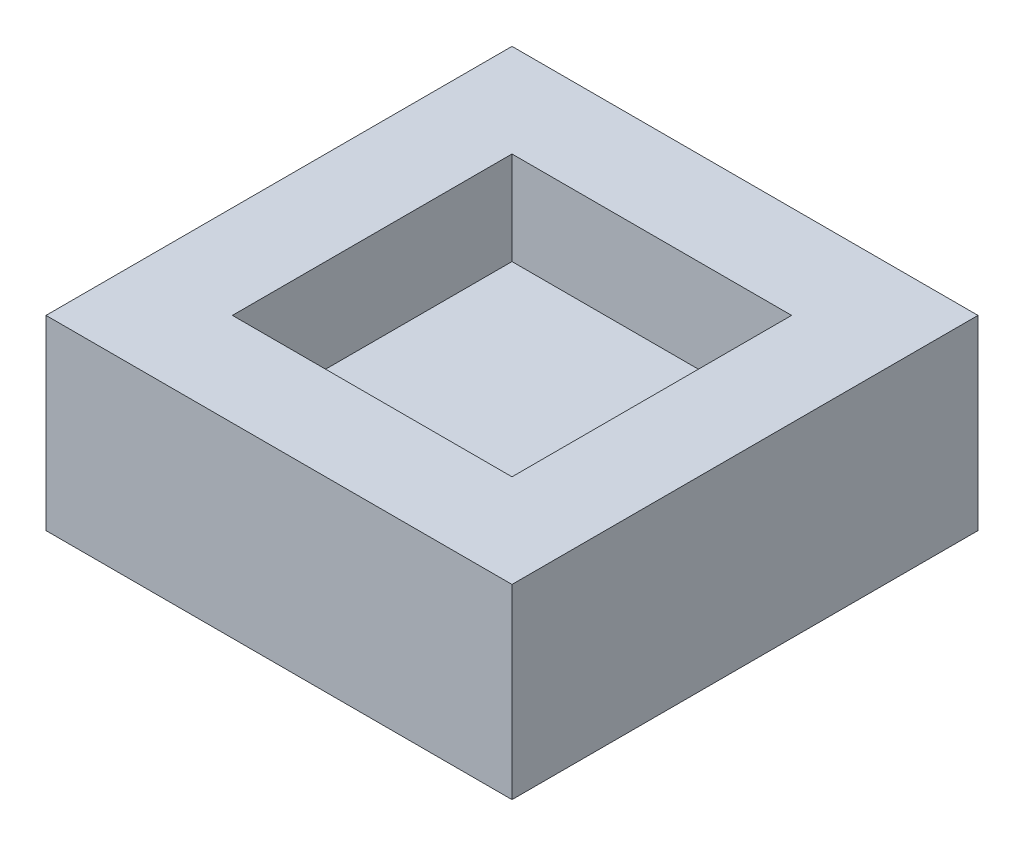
ISO-10303-21;
HEADER;
FILE_DESCRIPTION(('STEP AP214'),'2;1');
FILE_NAME('part.step','',(''),(''),'','','');
FILE_SCHEMA(('AUTOMOTIVE_DESIGN { 1 0 10303 214 1 1 1 1 }'));
ENDSEC;
DATA;
#1=APPLICATION_CONTEXT('core data for automotive mechanical design processes');
#2=APPLICATION_PROTOCOL_DEFINITION('international standard','automotive_design',2000,#1);
#3=PRODUCT_CONTEXT('',#1,'mechanical');
#4=PRODUCT('Part','Part','',(#3));
#5=PRODUCT_RELATED_PRODUCT_CATEGORY('part','',(#4));
#6=PRODUCT_DEFINITION_FORMATION('','',#4);
#7=PRODUCT_DEFINITION_CONTEXT('part definition',#1,'design');
#8=PRODUCT_DEFINITION('design','',#6,#7);
#9=PRODUCT_DEFINITION_SHAPE('','',#8);
#10=(LENGTH_UNIT() NAMED_UNIT(*) SI_UNIT(.MILLI.,.METRE.));
#11=(NAMED_UNIT(*) PLANE_ANGLE_UNIT() SI_UNIT($,.RADIAN.));
#12=(NAMED_UNIT(*) SI_UNIT($,.STERADIAN.) SOLID_ANGLE_UNIT());
#13=UNCERTAINTY_MEASURE_WITH_UNIT(LENGTH_MEASURE(1.E-05),#10,'distance_accuracy_value','');
#14=(GEOMETRIC_REPRESENTATION_CONTEXT(3) GLOBAL_UNCERTAINTY_ASSIGNED_CONTEXT((#13)) GLOBAL_UNIT_ASSIGNED_CONTEXT((#10,
#11,#12)) REPRESENTATION_CONTEXT('',''));
#15=CARTESIAN_POINT('',(0.,0.,0.));
#16=DIRECTION('',(0.,0.,1.));
#17=DIRECTION('',(1.,0.,0.));
#18=AXIS2_PLACEMENT_3D('',#15,#16,#17);
#19=CARTESIAN_POINT('',(0.,20.,0.));
#20=DIRECTION('',(1.,0.,0.));
#21=DIRECTION('',(0.,0.,-1.));
#22=AXIS2_PLACEMENT_3D('',#19,#20,#21);
#23=PLANE('',#22);
#24=DIRECTION('',(0.,0.,1.));
#25=VECTOR('',#24,1.);
#26=CARTESIAN_POINT('',(0.,0.,0.));
#27=LINE('',#26,#25);
#28=CARTESIAN_POINT('',(0.,0.,-50.));
#29=VERTEX_POINT('',#28);
#30=CARTESIAN_POINT('',(0.,0.,0.));
#31=VERTEX_POINT('',#30);
#32=EDGE_CURVE('E135',#29,#31,#27,.T.);
#33=ORIENTED_EDGE('',*,*,#32,.T.);
#34=DIRECTION('',(0.,-1.,0.));
#35=VECTOR('',#34,1.);
#36=CARTESIAN_POINT('',(0.,20.,0.));
#37=LINE('',#36,#35);
#38=CARTESIAN_POINT('',(0.,20.,0.));
#39=VERTEX_POINT('',#38);
#40=EDGE_CURVE('E11',#39,#31,#37,.T.);
#41=ORIENTED_EDGE('',*,*,#40,.F.);
#42=DIRECTION('',(0.,0.,1.));
#43=VECTOR('',#42,1.);
#44=CARTESIAN_POINT('',(0.,20.,0.));
#45=LINE('',#44,#43);
#46=CARTESIAN_POINT('',(0.,20.,-50.));
#47=VERTEX_POINT('',#46);
#48=EDGE_CURVE('E146',#47,#39,#45,.T.);
#49=ORIENTED_EDGE('',*,*,#48,.F.);
#50=DIRECTION('',(0.,-1.,0.));
#51=VECTOR('',#50,1.);
#52=CARTESIAN_POINT('',(0.,20.,-50.));
#53=LINE('',#52,#51);
#54=EDGE_CURVE('E153',#47,#29,#53,.T.);
#55=ORIENTED_EDGE('',*,*,#54,.T.);
#56=EDGE_LOOP('',(#33,#41,#49,#55));
#57=FACE_BOUND('',#56,.T.);
#58=ADVANCED_FACE('F33',(#57),#23,.F.);
#59=CARTESIAN_POINT('',(0.,20.,0.));
#60=DIRECTION('',(0.,0.,-1.));
#61=DIRECTION('',(-1.,0.,0.));
#62=AXIS2_PLACEMENT_3D('',#59,#60,#61);
#63=PLANE('',#62);
#64=DIRECTION('',(1.,0.,0.));
#65=VECTOR('',#64,1.);
#66=CARTESIAN_POINT('',(0.,0.,0.));
#67=LINE('',#66,#65);
#68=CARTESIAN_POINT('',(50.,0.,0.));
#69=VERTEX_POINT('',#68);
#70=EDGE_CURVE('E140',#31,#69,#67,.T.);
#71=ORIENTED_EDGE('',*,*,#70,.T.);
#72=DIRECTION('',(0.,-1.,0.));
#73=VECTOR('',#72,1.);
#74=CARTESIAN_POINT('',(50.,20.,0.));
#75=LINE('',#74,#73);
#76=CARTESIAN_POINT('',(50.,20.,0.));
#77=VERTEX_POINT('',#76);
#78=EDGE_CURVE('E40',#77,#69,#75,.T.);
#79=ORIENTED_EDGE('',*,*,#78,.F.);
#80=DIRECTION('',(1.,0.,0.));
#81=VECTOR('',#80,1.);
#82=CARTESIAN_POINT('',(0.,20.,0.));
#83=LINE('',#82,#81);
#84=EDGE_CURVE('E148',#39,#77,#83,.T.);
#85=ORIENTED_EDGE('',*,*,#84,.F.);
#86=ORIENTED_EDGE('',*,*,#40,.T.);
#87=EDGE_LOOP('',(#71,#79,#85,#86));
#88=FACE_BOUND('',#87,.T.);
#89=ADVANCED_FACE('F175',(#88),#63,.F.);
#90=CARTESIAN_POINT('',(50.,20.,0.));
#91=DIRECTION('',(-1.,0.,0.));
#92=DIRECTION('',(0.,0.,1.));
#93=AXIS2_PLACEMENT_3D('',#90,#91,#92);
#94=PLANE('',#93);
#95=DIRECTION('',(0.,0.,-1.));
#96=VECTOR('',#95,1.);
#97=CARTESIAN_POINT('',(50.,0.,0.));
#98=LINE('',#97,#96);
#99=CARTESIAN_POINT('',(50.,0.,-50.));
#100=VERTEX_POINT('',#99);
#101=EDGE_CURVE('E142',#69,#100,#98,.T.);
#102=ORIENTED_EDGE('',*,*,#101,.T.);
#103=DIRECTION('',(0.,-1.,0.));
#104=VECTOR('',#103,1.);
#105=CARTESIAN_POINT('',(50.,20.,-50.));
#106=LINE('',#105,#104);
#107=CARTESIAN_POINT('',(50.,20.,-50.));
#108=VERTEX_POINT('',#107);
#109=EDGE_CURVE('E156',#108,#100,#106,.T.);
#110=ORIENTED_EDGE('',*,*,#109,.F.);
#111=DIRECTION('',(0.,0.,-1.));
#112=VECTOR('',#111,1.);
#113=CARTESIAN_POINT('',(50.,20.,0.));
#114=LINE('',#113,#112);
#115=EDGE_CURVE('E150',#77,#108,#114,.T.);
#116=ORIENTED_EDGE('',*,*,#115,.F.);
#117=ORIENTED_EDGE('',*,*,#78,.T.);
#118=EDGE_LOOP('',(#102,#110,#116,#117));
#119=FACE_BOUND('',#118,.T.);
#120=ADVANCED_FACE('F163',(#119),#94,.F.);
#121=CARTESIAN_POINT('',(0.,20.,-50.));
#122=DIRECTION('',(0.,0.,1.));
#123=DIRECTION('',(1.,0.,0.));
#124=AXIS2_PLACEMENT_3D('',#121,#122,#123);
#125=PLANE('',#124);
#126=DIRECTION('',(-1.,0.,0.));
#127=VECTOR('',#126,1.);
#128=CARTESIAN_POINT('',(0.,0.,-50.));
#129=LINE('',#128,#127);
#130=EDGE_CURVE('E144',#100,#29,#129,.T.);
#131=ORIENTED_EDGE('',*,*,#130,.T.);
#132=ORIENTED_EDGE('',*,*,#54,.F.);
#133=DIRECTION('',(-1.,0.,0.));
#134=VECTOR('',#133,1.);
#135=CARTESIAN_POINT('',(0.,20.,-50.));
#136=LINE('',#135,#134);
#137=EDGE_CURVE('E55',#108,#47,#136,.T.);
#138=ORIENTED_EDGE('',*,*,#137,.F.);
#139=ORIENTED_EDGE('',*,*,#109,.T.);
#140=EDGE_LOOP('',(#131,#132,#138,#139));
#141=FACE_BOUND('',#140,.T.);
#142=ADVANCED_FACE('F171',(#141),#125,.F.);
#143=CARTESIAN_POINT('',(0.,20.,-50.));
#144=DIRECTION('',(0.,-1.,0.));
#145=DIRECTION('',(0.,0.,-1.));
#146=AXIS2_PLACEMENT_3D('',#143,#144,#145);
#147=PLANE('',#146);
#148=DIRECTION('',(0.,0.,1.));
#149=VECTOR('',#148,1.);
#150=CARTESIAN_POINT('',(10.,20.,-40.));
#151=LINE('',#150,#149);
#152=CARTESIAN_POINT('',(10.,20.,-40.));
#153=VERTEX_POINT('',#152);
#154=CARTESIAN_POINT('',(10.,20.,-10.));
#155=VERTEX_POINT('',#154);
#156=EDGE_CURVE('E113',#153,#155,#151,.T.);
#157=ORIENTED_EDGE('',*,*,#156,.F.);
#158=DIRECTION('',(-1.,0.,0.));
#159=VECTOR('',#158,1.);
#160=CARTESIAN_POINT('',(40.,20.,-40.));
#161=LINE('',#160,#159);
#162=CARTESIAN_POINT('',(40.,20.,-40.));
#163=VERTEX_POINT('',#162);
#164=EDGE_CURVE('E47',#163,#153,#161,.T.);
#165=ORIENTED_EDGE('',*,*,#164,.F.);
#166=DIRECTION('',(0.,0.,-1.));
#167=VECTOR('',#166,1.);
#168=CARTESIAN_POINT('',(40.,20.,-10.));
#169=LINE('',#168,#167);
#170=CARTESIAN_POINT('',(40.,20.,-10.));
#171=VERTEX_POINT('',#170);
#172=EDGE_CURVE('E119',#171,#163,#169,.T.);
#173=ORIENTED_EDGE('',*,*,#172,.F.);
#174=DIRECTION('',(1.,0.,0.));
#175=VECTOR('',#174,1.);
#176=CARTESIAN_POINT('',(10.,20.,-10.));
#177=LINE('',#176,#175);
#178=EDGE_CURVE('E102',#155,#171,#177,.T.);
#179=ORIENTED_EDGE('',*,*,#178,.F.);
#180=EDGE_LOOP('',(#157,#165,#173,#179));
#181=FACE_BOUND('',#180,.T.);
#182=ORIENTED_EDGE('',*,*,#48,.T.);
#183=ORIENTED_EDGE('',*,*,#84,.T.);
#184=ORIENTED_EDGE('',*,*,#115,.T.);
#185=ORIENTED_EDGE('',*,*,#137,.T.);
#186=EDGE_LOOP('',(#182,#183,#184,#185));
#187=FACE_BOUND('',#186,.T.);
#188=ADVANCED_FACE('F117',(#181,#187),#147,.F.);
#189=CARTESIAN_POINT('',(0.,0.,-50.));
#190=DIRECTION('',(0.,-1.,0.));
#191=DIRECTION('',(0.,0.,-1.));
#192=AXIS2_PLACEMENT_3D('',#189,#190,#191);
#193=PLANE('',#192);
#194=ORIENTED_EDGE('',*,*,#32,.F.);
#195=ORIENTED_EDGE('',*,*,#130,.F.);
#196=ORIENTED_EDGE('',*,*,#101,.F.);
#197=ORIENTED_EDGE('',*,*,#70,.F.);
#198=EDGE_LOOP('',(#194,#195,#196,#197));
#199=FACE_BOUND('',#198,.T.);
#200=ADVANCED_FACE('F169',(#199),#193,.T.);
#201=CARTESIAN_POINT('',(40.,10.,-40.));
#202=DIRECTION('',(0.,0.,-1.));
#203=DIRECTION('',(-1.,0.,0.));
#204=AXIS2_PLACEMENT_3D('',#201,#202,#203);
#205=PLANE('',#204);
#206=ORIENTED_EDGE('',*,*,#164,.T.);
#207=DIRECTION('',(0.,1.,0.));
#208=VECTOR('',#207,1.);
#209=CARTESIAN_POINT('',(10.,10.,-40.));
#210=LINE('',#209,#208);
#211=CARTESIAN_POINT('',(10.,10.,-40.));
#212=VERTEX_POINT('',#211);
#213=EDGE_CURVE('E110',#212,#153,#210,.T.);
#214=ORIENTED_EDGE('',*,*,#213,.F.);
#215=DIRECTION('',(-1.,0.,0.));
#216=VECTOR('',#215,1.);
#217=CARTESIAN_POINT('',(40.,10.,-40.));
#218=LINE('',#217,#216);
#219=CARTESIAN_POINT('',(40.,10.,-40.));
#220=VERTEX_POINT('',#219);
#221=EDGE_CURVE('E121',#220,#212,#218,.T.);
#222=ORIENTED_EDGE('',*,*,#221,.F.);
#223=DIRECTION('',(0.,1.,0.));
#224=VECTOR('',#223,1.);
#225=CARTESIAN_POINT('',(40.,10.,-40.));
#226=LINE('',#225,#224);
#227=EDGE_CURVE('E133',#220,#163,#226,.T.);
#228=ORIENTED_EDGE('',*,*,#227,.T.);
#229=EDGE_LOOP('',(#206,#214,#222,#228));
#230=FACE_BOUND('',#229,.T.);
#231=ADVANCED_FACE('F189',(#230),#205,.F.);
#232=CARTESIAN_POINT('',(40.,10.,-10.));
#233=DIRECTION('',(1.,0.,0.));
#234=DIRECTION('',(0.,0.,-1.));
#235=AXIS2_PLACEMENT_3D('',#232,#233,#234);
#236=PLANE('',#235);
#237=ORIENTED_EDGE('',*,*,#172,.T.);
#238=ORIENTED_EDGE('',*,*,#227,.F.);
#239=DIRECTION('',(0.,0.,-1.));
#240=VECTOR('',#239,1.);
#241=CARTESIAN_POINT('',(40.,10.,-10.));
#242=LINE('',#241,#240);
#243=CARTESIAN_POINT('',(40.,10.,-10.));
#244=VERTEX_POINT('',#243);
#245=EDGE_CURVE('E130',#244,#220,#242,.T.);
#246=ORIENTED_EDGE('',*,*,#245,.F.);
#247=DIRECTION('',(0.,1.,0.));
#248=VECTOR('',#247,1.);
#249=CARTESIAN_POINT('',(40.,10.,-10.));
#250=LINE('',#249,#248);
#251=EDGE_CURVE('E109',#244,#171,#250,.T.);
#252=ORIENTED_EDGE('',*,*,#251,.T.);
#253=EDGE_LOOP('',(#237,#238,#246,#252));
#254=FACE_BOUND('',#253,.T.);
#255=ADVANCED_FACE('F192',(#254),#236,.F.);
#256=CARTESIAN_POINT('',(10.,10.,-10.));
#257=DIRECTION('',(0.,0.,1.));
#258=DIRECTION('',(1.,0.,0.));
#259=AXIS2_PLACEMENT_3D('',#256,#257,#258);
#260=PLANE('',#259);
#261=ORIENTED_EDGE('',*,*,#178,.T.);
#262=ORIENTED_EDGE('',*,*,#251,.F.);
#263=DIRECTION('',(1.,0.,0.));
#264=VECTOR('',#263,1.);
#265=CARTESIAN_POINT('',(10.,10.,-10.));
#266=LINE('',#265,#264);
#267=CARTESIAN_POINT('',(10.,10.,-10.));
#268=VERTEX_POINT('',#267);
#269=EDGE_CURVE('E105',#268,#244,#266,.T.);
#270=ORIENTED_EDGE('',*,*,#269,.F.);
#271=DIRECTION('',(0.,1.,0.));
#272=VECTOR('',#271,1.);
#273=CARTESIAN_POINT('',(10.,10.,-10.));
#274=LINE('',#273,#272);
#275=EDGE_CURVE('E98',#268,#155,#274,.T.);
#276=ORIENTED_EDGE('',*,*,#275,.T.);
#277=EDGE_LOOP('',(#261,#262,#270,#276));
#278=FACE_BOUND('',#277,.T.);
#279=ADVANCED_FACE('F100',(#278),#260,.F.);
#280=CARTESIAN_POINT('',(10.,10.,-40.));
#281=DIRECTION('',(-1.,0.,0.));
#282=DIRECTION('',(0.,0.,1.));
#283=AXIS2_PLACEMENT_3D('',#280,#281,#282);
#284=PLANE('',#283);
#285=ORIENTED_EDGE('',*,*,#156,.T.);
#286=ORIENTED_EDGE('',*,*,#275,.F.);
#287=DIRECTION('',(0.,0.,1.));
#288=VECTOR('',#287,1.);
#289=CARTESIAN_POINT('',(10.,10.,-40.));
#290=LINE('',#289,#288);
#291=EDGE_CURVE('E127',#212,#268,#290,.T.);
#292=ORIENTED_EDGE('',*,*,#291,.F.);
#293=ORIENTED_EDGE('',*,*,#213,.T.);
#294=EDGE_LOOP('',(#285,#286,#292,#293));
#295=FACE_BOUND('',#294,.T.);
#296=ADVANCED_FACE('F114',(#295),#284,.F.);
#297=CARTESIAN_POINT('',(10.,10.,-40.));
#298=DIRECTION('',(0.,1.,0.));
#299=DIRECTION('',(0.,0.,1.));
#300=AXIS2_PLACEMENT_3D('',#297,#298,#299);
#301=PLANE('',#300);
#302=ORIENTED_EDGE('',*,*,#221,.T.);
#303=ORIENTED_EDGE('',*,*,#291,.T.);
#304=ORIENTED_EDGE('',*,*,#269,.T.);
#305=ORIENTED_EDGE('',*,*,#245,.T.);
#306=EDGE_LOOP('',(#302,#303,#304,#305));
#307=FACE_BOUND('',#306,.T.);
#308=ADVANCED_FACE('F195',(#307),#301,.T.);
#309=CLOSED_SHELL('',(#58,#89,#120,#142,#188,#200,#231,#255,#279,#296,#308));
#310=MANIFOLD_SOLID_BREP('B2',#309);
#311=ADVANCED_BREP_SHAPE_REPRESENTATION('',(#18,#310),#14);
#312=SHAPE_DEFINITION_REPRESENTATION(#9,#311);
ENDSEC;
END-ISO-10303-21;
